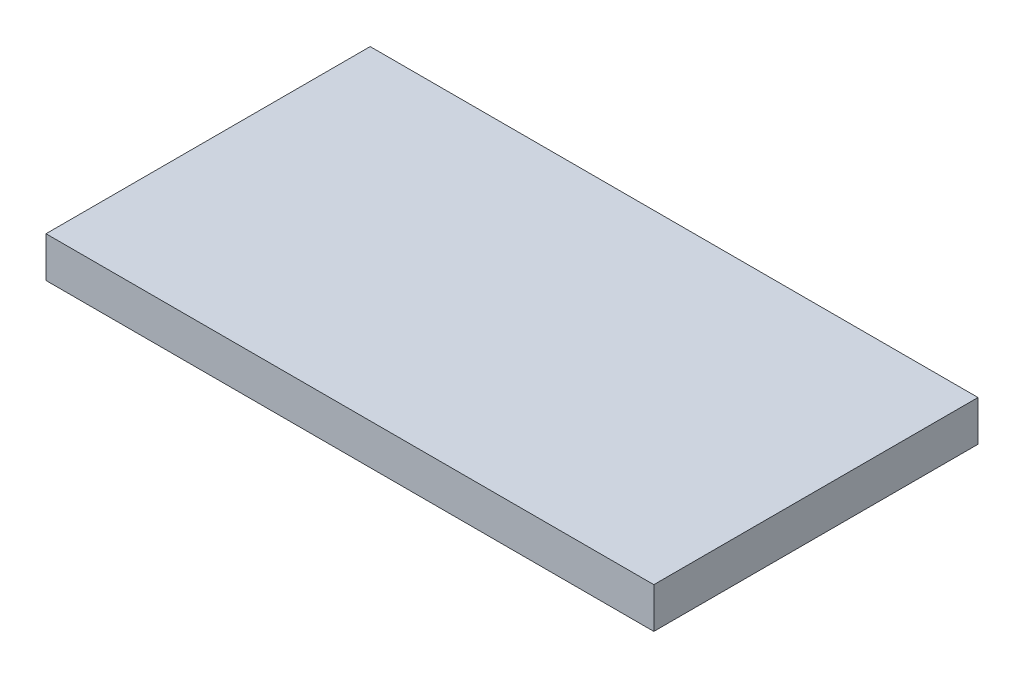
from build123d import *

# Parameters (mm, degrees)
SKETCH1_W           = 150
SKETCH1_H           = 80
BOSS_EXTRUDE1_DEPTH = 10


with BuildPart() as part:
    # Sketch1 → Boss-Extrude1 (new body)
    with BuildSketch(Plane(origin=(0, 0, 0), x_dir=(1, 0, 0), z_dir=(0, 1, 0))):
        Rectangle(SKETCH1_W, SKETCH1_H)
    extrude(amount=BOSS_EXTRUDE1_DEPTH)


solid = part.part
